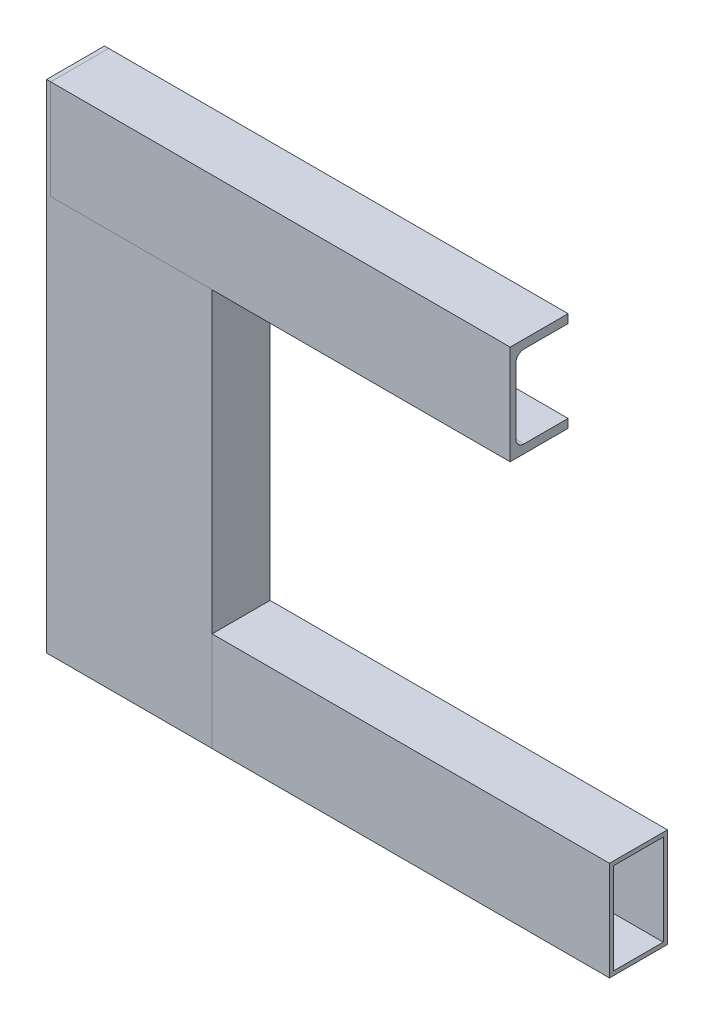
ISO-10303-21;
HEADER;
FILE_DESCRIPTION(('STEP AP214'),'2;1');
FILE_NAME('part.step','',(''),(''),'','','');
FILE_SCHEMA(('AUTOMOTIVE_DESIGN { 1 0 10303 214 1 1 1 1 }'));
ENDSEC;
DATA;
#1=APPLICATION_CONTEXT('core data for automotive mechanical design processes');
#2=APPLICATION_PROTOCOL_DEFINITION('international standard','automotive_design',2000,#1);
#3=PRODUCT_CONTEXT('',#1,'mechanical');
#4=PRODUCT('Part','Part','',(#3));
#5=PRODUCT_RELATED_PRODUCT_CATEGORY('part','',(#4));
#6=PRODUCT_DEFINITION_FORMATION('','',#4);
#7=PRODUCT_DEFINITION_CONTEXT('part definition',#1,'design');
#8=PRODUCT_DEFINITION('design','',#6,#7);
#9=PRODUCT_DEFINITION_SHAPE('','',#8);
#10=(LENGTH_UNIT() NAMED_UNIT(*) SI_UNIT(.MILLI.,.METRE.));
#11=(NAMED_UNIT(*) PLANE_ANGLE_UNIT() SI_UNIT($,.RADIAN.));
#12=(NAMED_UNIT(*) SI_UNIT($,.STERADIAN.) SOLID_ANGLE_UNIT());
#13=UNCERTAINTY_MEASURE_WITH_UNIT(LENGTH_MEASURE(1.E-05),#10,'distance_accuracy_value','');
#14=(GEOMETRIC_REPRESENTATION_CONTEXT(3) GLOBAL_UNCERTAINTY_ASSIGNED_CONTEXT((#13)) GLOBAL_UNIT_ASSIGNED_CONTEXT((#10,
#11,#12)) REPRESENTATION_CONTEXT('',''));
#15=CARTESIAN_POINT('',(0.,0.,0.));
#16=DIRECTION('',(0.,0.,1.));
#17=DIRECTION('',(1.,0.,0.));
#18=AXIS2_PLACEMENT_3D('',#15,#16,#17);
#19=CARTESIAN_POINT('',(431.8,-381.,0.));
#20=DIRECTION('',(0.,0.,-1.));
#21=DIRECTION('',(-1.,0.,0.));
#22=AXIS2_PLACEMENT_3D('',#19,#20,#21);
#23=PLANE('',#22);
#24=DIRECTION('',(0.,1.,0.));
#25=VECTOR('',#24,1.);
#26=CARTESIAN_POINT('',(127.,-381.,0.));
#27=LINE('',#26,#25);
#28=CARTESIAN_POINT('',(127.,-381.,0.));
#29=VERTEX_POINT('',#28);
#30=CARTESIAN_POINT('',(127.,-304.8,0.));
#31=VERTEX_POINT('',#30);
#32=EDGE_CURVE('E55',#29,#31,#27,.T.);
#33=ORIENTED_EDGE('',*,*,#32,.F.);
#34=DIRECTION('',(-1.,0.,0.));
#35=VECTOR('',#34,1.);
#36=CARTESIAN_POINT('',(431.8,-381.,0.));
#37=LINE('',#36,#35);
#38=CARTESIAN_POINT('',(431.8,-381.,0.));
#39=VERTEX_POINT('',#38);
#40=EDGE_CURVE('E119',#39,#29,#37,.T.);
#41=ORIENTED_EDGE('',*,*,#40,.F.);
#42=DIRECTION('',(0.,-1.,0.));
#43=VECTOR('',#42,1.);
#44=CARTESIAN_POINT('',(431.8,-381.,0.));
#45=LINE('',#44,#43);
#46=CARTESIAN_POINT('',(431.8,-304.8,0.));
#47=VERTEX_POINT('',#46);
#48=EDGE_CURVE('E157',#47,#39,#45,.T.);
#49=ORIENTED_EDGE('',*,*,#48,.F.);
#50=DIRECTION('',(-1.,0.,0.));
#51=VECTOR('',#50,1.);
#52=CARTESIAN_POINT('',(431.8,-304.8,0.));
#53=LINE('',#52,#51);
#54=EDGE_CURVE('E122',#47,#31,#53,.T.);
#55=ORIENTED_EDGE('',*,*,#54,.T.);
#56=EDGE_LOOP('',(#33,#41,#49,#55));
#57=FACE_BOUND('',#56,.T.);
#58=ADVANCED_FACE('F46',(#57),#23,.F.);
#59=CARTESIAN_POINT('',(431.8,-304.8,-44.45));
#60=DIRECTION('',(0.,-1.,0.));
#61=DIRECTION('',(0.,0.,-1.));
#62=AXIS2_PLACEMENT_3D('',#59,#60,#61);
#63=PLANE('',#62);
#64=DIRECTION('',(0.,0.,-1.));
#65=VECTOR('',#64,1.);
#66=CARTESIAN_POINT('',(127.,-304.8,-44.45));
#67=LINE('',#66,#65);
#68=CARTESIAN_POINT('',(127.,-304.8,-44.45));
#69=VERTEX_POINT('',#68);
#70=EDGE_CURVE('E12',#31,#69,#67,.T.);
#71=ORIENTED_EDGE('',*,*,#70,.F.);
#72=ORIENTED_EDGE('',*,*,#54,.F.);
#73=DIRECTION('',(0.,0.,1.));
#74=VECTOR('',#73,1.);
#75=CARTESIAN_POINT('',(431.8,-304.8,-44.45));
#76=LINE('',#75,#74);
#77=CARTESIAN_POINT('',(431.8,-304.8,-44.45));
#78=VERTEX_POINT('',#77);
#79=EDGE_CURVE('E159',#78,#47,#76,.T.);
#80=ORIENTED_EDGE('',*,*,#79,.F.);
#81=DIRECTION('',(-1.,0.,0.));
#82=VECTOR('',#81,1.);
#83=CARTESIAN_POINT('',(431.8,-304.8,-44.45));
#84=LINE('',#83,#82);
#85=EDGE_CURVE('E168',#78,#69,#84,.T.);
#86=ORIENTED_EDGE('',*,*,#85,.T.);
#87=EDGE_LOOP('',(#71,#72,#80,#86));
#88=FACE_BOUND('',#87,.T.);
#89=ADVANCED_FACE('F183',(#88),#63,.F.);
#90=CARTESIAN_POINT('',(431.8,-381.,-44.45));
#91=DIRECTION('',(0.,0.,1.));
#92=DIRECTION('',(1.,0.,0.));
#93=AXIS2_PLACEMENT_3D('',#90,#91,#92);
#94=PLANE('',#93);
#95=DIRECTION('',(0.,1.,0.));
#96=VECTOR('',#95,1.);
#97=CARTESIAN_POINT('',(127.,-381.,-44.45));
#98=LINE('',#97,#96);
#99=CARTESIAN_POINT('',(127.,-381.,-44.45));
#100=VERTEX_POINT('',#99);
#101=EDGE_CURVE('E62',#100,#69,#98,.T.);
#102=ORIENTED_EDGE('',*,*,#101,.T.);
#103=ORIENTED_EDGE('',*,*,#85,.F.);
#104=DIRECTION('',(0.,1.,0.));
#105=VECTOR('',#104,1.);
#106=CARTESIAN_POINT('',(431.8,-381.,-44.45));
#107=LINE('',#106,#105);
#108=CARTESIAN_POINT('',(431.8,-381.,-44.45));
#109=VERTEX_POINT('',#108);
#110=EDGE_CURVE('E129',#109,#78,#107,.T.);
#111=ORIENTED_EDGE('',*,*,#110,.F.);
#112=DIRECTION('',(-1.,0.,0.));
#113=VECTOR('',#112,1.);
#114=CARTESIAN_POINT('',(431.8,-381.,-44.45));
#115=LINE('',#114,#113);
#116=EDGE_CURVE('E127',#109,#100,#115,.T.);
#117=ORIENTED_EDGE('',*,*,#116,.T.);
#118=EDGE_LOOP('',(#102,#103,#111,#117));
#119=FACE_BOUND('',#118,.T.);
#120=ADVANCED_FACE('F185',(#119),#94,.F.);
#121=CARTESIAN_POINT('',(431.8,-381.,-44.45));
#122=DIRECTION('',(0.,1.,0.));
#123=DIRECTION('',(0.,0.,1.));
#124=AXIS2_PLACEMENT_3D('',#121,#122,#123);
#125=PLANE('',#124);
#126=DIRECTION('',(0.,0.,1.));
#127=VECTOR('',#126,1.);
#128=CARTESIAN_POINT('',(127.,-381.,-44.45));
#129=LINE('',#128,#127);
#130=EDGE_CURVE('E106',#100,#29,#129,.T.);
#131=ORIENTED_EDGE('',*,*,#130,.F.);
#132=ORIENTED_EDGE('',*,*,#116,.F.);
#133=DIRECTION('',(0.,0.,-1.));
#134=VECTOR('',#133,1.);
#135=CARTESIAN_POINT('',(431.8,-381.,-44.45));
#136=LINE('',#135,#134);
#137=EDGE_CURVE('E126',#39,#109,#136,.T.);
#138=ORIENTED_EDGE('',*,*,#137,.F.);
#139=ORIENTED_EDGE('',*,*,#40,.T.);
#140=EDGE_LOOP('',(#131,#132,#138,#139));
#141=FACE_BOUND('',#140,.T.);
#142=ADVANCED_FACE('F124',(#141),#125,.F.);
#143=CARTESIAN_POINT('',(431.8,-381.,0.));
#144=DIRECTION('',(-1.,0.,0.));
#145=DIRECTION('',(0.,0.,1.));
#146=AXIS2_PLACEMENT_3D('',#143,#144,#145);
#147=PLANE('',#146);
#148=ORIENTED_EDGE('',*,*,#137,.T.);
#149=ORIENTED_EDGE('',*,*,#110,.T.);
#150=ORIENTED_EDGE('',*,*,#79,.T.);
#151=ORIENTED_EDGE('',*,*,#48,.T.);
#152=EDGE_LOOP('',(#148,#149,#150,#151));
#153=FACE_BOUND('',#152,.T.);
#154=DIRECTION('',(0.,0.,-1.));
#155=VECTOR('',#154,1.);
#156=CARTESIAN_POINT('',(431.8,-377.825,-41.275));
#157=LINE('',#156,#155);
#158=CARTESIAN_POINT('',(431.8,-377.825,-3.175));
#159=VERTEX_POINT('',#158);
#160=CARTESIAN_POINT('',(431.8,-377.825,-41.275));
#161=VERTEX_POINT('',#160);
#162=EDGE_CURVE('E113',#159,#161,#157,.T.);
#163=ORIENTED_EDGE('',*,*,#162,.F.);
#164=DIRECTION('',(0.,-1.,0.));
#165=VECTOR('',#164,1.);
#166=CARTESIAN_POINT('',(431.8,-377.825,-3.175));
#167=LINE('',#166,#165);
#168=CARTESIAN_POINT('',(431.8,-307.975,-3.175));
#169=VERTEX_POINT('',#168);
#170=EDGE_CURVE('E150',#169,#159,#167,.T.);
#171=ORIENTED_EDGE('',*,*,#170,.F.);
#172=DIRECTION('',(0.,0.,1.));
#173=VECTOR('',#172,1.);
#174=CARTESIAN_POINT('',(431.8,-307.975,-41.275));
#175=LINE('',#174,#173);
#176=CARTESIAN_POINT('',(431.8,-307.975,-41.275));
#177=VERTEX_POINT('',#176);
#178=EDGE_CURVE('E139',#177,#169,#175,.T.);
#179=ORIENTED_EDGE('',*,*,#178,.F.);
#180=DIRECTION('',(0.,1.,0.));
#181=VECTOR('',#180,1.);
#182=CARTESIAN_POINT('',(431.8,-377.825,-41.275));
#183=LINE('',#182,#181);
#184=EDGE_CURVE('E144',#161,#177,#183,.T.);
#185=ORIENTED_EDGE('',*,*,#184,.F.);
#186=EDGE_LOOP('',(#163,#171,#179,#185));
#187=FACE_BOUND('',#186,.T.);
#188=ADVANCED_FACE('F187',(#153,#187),#147,.F.);
#189=CARTESIAN_POINT('',(431.8,-377.825,-41.275));
#190=DIRECTION('',(0.,0.,1.));
#191=DIRECTION('',(1.,0.,0.));
#192=AXIS2_PLACEMENT_3D('',#189,#190,#191);
#193=PLANE('',#192);
#194=DIRECTION('',(-1.,0.,0.));
#195=VECTOR('',#194,1.);
#196=CARTESIAN_POINT('',(431.8,-307.975,-41.275));
#197=LINE('',#196,#195);
#198=CARTESIAN_POINT('',(127.,-307.975,-41.275));
#199=VERTEX_POINT('',#198);
#200=EDGE_CURVE('E50',#177,#199,#197,.T.);
#201=ORIENTED_EDGE('',*,*,#200,.T.);
#202=DIRECTION('',(0.,-1.,0.));
#203=VECTOR('',#202,1.);
#204=CARTESIAN_POINT('',(127.,-377.825,-41.275));
#205=LINE('',#204,#203);
#206=CARTESIAN_POINT('',(127.,-377.825,-41.275));
#207=VERTEX_POINT('',#206);
#208=EDGE_CURVE('E147',#199,#207,#205,.T.);
#209=ORIENTED_EDGE('',*,*,#208,.T.);
#210=DIRECTION('',(-1.,0.,0.));
#211=VECTOR('',#210,1.);
#212=CARTESIAN_POINT('',(431.8,-377.825,-41.275));
#213=LINE('',#212,#211);
#214=EDGE_CURVE('E153',#161,#207,#213,.T.);
#215=ORIENTED_EDGE('',*,*,#214,.F.);
#216=ORIENTED_EDGE('',*,*,#184,.T.);
#217=EDGE_LOOP('',(#201,#209,#215,#216));
#218=FACE_BOUND('',#217,.T.);
#219=ADVANCED_FACE('F176',(#218),#193,.T.);
#220=CARTESIAN_POINT('',(431.8,-307.975,-41.275));
#221=DIRECTION('',(0.,-1.,0.));
#222=DIRECTION('',(0.,0.,-1.));
#223=AXIS2_PLACEMENT_3D('',#220,#221,#222);
#224=PLANE('',#223);
#225=DIRECTION('',(-1.,0.,0.));
#226=VECTOR('',#225,1.);
#227=CARTESIAN_POINT('',(431.8,-307.975,-3.175));
#228=LINE('',#227,#226);
#229=CARTESIAN_POINT('',(127.,-307.975,-3.175));
#230=VERTEX_POINT('',#229);
#231=EDGE_CURVE('E140',#169,#230,#228,.T.);
#232=ORIENTED_EDGE('',*,*,#231,.T.);
#233=DIRECTION('',(0.,0.,-1.));
#234=VECTOR('',#233,1.);
#235=CARTESIAN_POINT('',(127.,-307.975,-41.275));
#236=LINE('',#235,#234);
#237=EDGE_CURVE('E143',#230,#199,#236,.T.);
#238=ORIENTED_EDGE('',*,*,#237,.T.);
#239=ORIENTED_EDGE('',*,*,#200,.F.);
#240=ORIENTED_EDGE('',*,*,#178,.T.);
#241=EDGE_LOOP('',(#232,#238,#239,#240));
#242=FACE_BOUND('',#241,.T.);
#243=ADVANCED_FACE('F196',(#242),#224,.T.);
#244=CARTESIAN_POINT('',(431.8,-377.825,-3.175));
#245=DIRECTION('',(0.,0.,-1.));
#246=DIRECTION('',(-1.,0.,0.));
#247=AXIS2_PLACEMENT_3D('',#244,#245,#246);
#248=PLANE('',#247);
#249=DIRECTION('',(-1.,0.,0.));
#250=VECTOR('',#249,1.);
#251=CARTESIAN_POINT('',(431.8,-377.825,-3.175));
#252=LINE('',#251,#250);
#253=CARTESIAN_POINT('',(127.,-377.825,-3.175));
#254=VERTEX_POINT('',#253);
#255=EDGE_CURVE('E135',#159,#254,#252,.T.);
#256=ORIENTED_EDGE('',*,*,#255,.T.);
#257=DIRECTION('',(0.,1.,0.));
#258=VECTOR('',#257,1.);
#259=CARTESIAN_POINT('',(127.,-377.825,-3.175));
#260=LINE('',#259,#258);
#261=EDGE_CURVE('E138',#254,#230,#260,.T.);
#262=ORIENTED_EDGE('',*,*,#261,.T.);
#263=ORIENTED_EDGE('',*,*,#231,.F.);
#264=ORIENTED_EDGE('',*,*,#170,.T.);
#265=EDGE_LOOP('',(#256,#262,#263,#264));
#266=FACE_BOUND('',#265,.T.);
#267=ADVANCED_FACE('F194',(#266),#248,.T.);
#268=CARTESIAN_POINT('',(431.8,-377.825,-41.275));
#269=DIRECTION('',(0.,1.,0.));
#270=DIRECTION('',(0.,0.,1.));
#271=AXIS2_PLACEMENT_3D('',#268,#269,#270);
#272=PLANE('',#271);
#273=ORIENTED_EDGE('',*,*,#214,.T.);
#274=DIRECTION('',(0.,0.,1.));
#275=VECTOR('',#274,1.);
#276=CARTESIAN_POINT('',(127.,-377.825,-41.275));
#277=LINE('',#276,#275);
#278=EDGE_CURVE('E156',#207,#254,#277,.T.);
#279=ORIENTED_EDGE('',*,*,#278,.T.);
#280=ORIENTED_EDGE('',*,*,#255,.F.);
#281=ORIENTED_EDGE('',*,*,#162,.T.);
#282=EDGE_LOOP('',(#273,#279,#280,#281));
#283=FACE_BOUND('',#282,.T.);
#284=ADVANCED_FACE('F48',(#283),#272,.T.);
#285=CARTESIAN_POINT('',(127.,-381.,0.));
#286=DIRECTION('',(-1.,0.,0.));
#287=DIRECTION('',(0.,-1.,0.));
#288=AXIS2_PLACEMENT_3D('',#285,#286,#287);
#289=PLANE('',#288);
#290=ORIENTED_EDGE('',*,*,#208,.F.);
#291=ORIENTED_EDGE('',*,*,#237,.F.);
#292=ORIENTED_EDGE('',*,*,#261,.F.);
#293=ORIENTED_EDGE('',*,*,#278,.F.);
#294=EDGE_LOOP('',(#290,#291,#292,#293));
#295=FACE_BOUND('',#294,.T.);
#296=ORIENTED_EDGE('',*,*,#130,.T.);
#297=ORIENTED_EDGE('',*,*,#32,.T.);
#298=ORIENTED_EDGE('',*,*,#70,.T.);
#299=ORIENTED_EDGE('',*,*,#101,.F.);
#300=EDGE_LOOP('',(#296,#297,#298,#299));
#301=FACE_BOUND('',#300,.T.);
#302=ADVANCED_FACE('F108',(#295,#301),#289,.T.);
#303=CLOSED_SHELL('',(#58,#89,#120,#142,#188,#219,#243,#267,#284,#302));
#304=MANIFOLD_SOLID_BREP('B2',#303);
#305=CARTESIAN_POINT('',(3.17500000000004,-381.,-3.175));
#306=DIRECTION('',(0.,0.,-1.));
#307=DIRECTION('',(-1.,0.,0.));
#308=AXIS2_PLACEMENT_3D('',#305,#306,#307);
#309=PLANE('',#308);
#310=DIRECTION('',(-1.,0.,0.));
#311=VECTOR('',#310,1.);
#312=CARTESIAN_POINT('',(3.17500000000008,-76.2,-3.175));
#313=LINE('',#312,#311);
#314=CARTESIAN_POINT('',(123.825,-76.2,-3.175));
#315=VERTEX_POINT('',#314);
#316=CARTESIAN_POINT('',(3.17499999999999,-76.2,-3.175));
#317=VERTEX_POINT('',#316);
#318=EDGE_CURVE('E397',#315,#317,#313,.T.);
#319=ORIENTED_EDGE('',*,*,#318,.F.);
#320=DIRECTION('',(0.,1.,0.));
#321=VECTOR('',#320,1.);
#322=CARTESIAN_POINT('',(123.825,-381.,-3.175));
#323=LINE('',#322,#321);
#324=CARTESIAN_POINT('',(123.825,-381.,-3.175));
#325=VERTEX_POINT('',#324);
#326=EDGE_CURVE('E44',#325,#315,#323,.T.);
#327=ORIENTED_EDGE('',*,*,#326,.F.);
#328=DIRECTION('',(-1.,0.,0.));
#329=VECTOR('',#328,1.);
#330=CARTESIAN_POINT('',(3.17500000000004,-381.,-3.175));
#331=LINE('',#330,#329);
#332=CARTESIAN_POINT('',(3.17500000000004,-381.,-3.175));
#333=VERTEX_POINT('',#332);
#334=EDGE_CURVE('E385',#325,#333,#331,.T.);
#335=ORIENTED_EDGE('',*,*,#334,.T.);
#336=DIRECTION('',(0.,1.,0.));
#337=VECTOR('',#336,1.);
#338=CARTESIAN_POINT('',(3.17500000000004,-381.,-3.175));
#339=LINE('',#338,#337);
#340=EDGE_CURVE('E324',#333,#317,#339,.T.);
#341=ORIENTED_EDGE('',*,*,#340,.T.);
#342=EDGE_LOOP('',(#319,#327,#335,#341));
#343=FACE_BOUND('',#342,.T.);
#344=ADVANCED_FACE('F305',(#343),#309,.T.);
#345=CARTESIAN_POINT('',(123.825,-381.,-3.175));
#346=DIRECTION('',(-1.,0.,0.));
#347=DIRECTION('',(0.,-1.,0.));
#348=AXIS2_PLACEMENT_3D('',#345,#346,#347);
#349=PLANE('',#348);
#350=DIRECTION('',(0.,0.,1.));
#351=VECTOR('',#350,1.);
#352=CARTESIAN_POINT('',(123.825,-76.2,-3.175));
#353=LINE('',#352,#351);
#354=CARTESIAN_POINT('',(123.825,-76.2,-41.275));
#355=VERTEX_POINT('',#354);
#356=EDGE_CURVE('E348',#355,#315,#353,.T.);
#357=ORIENTED_EDGE('',*,*,#356,.F.);
#358=DIRECTION('',(0.,1.,0.));
#359=VECTOR('',#358,1.);
#360=CARTESIAN_POINT('',(123.825,-381.,-41.275));
#361=LINE('',#360,#359);
#362=CARTESIAN_POINT('',(123.825,-381.,-41.275));
#363=VERTEX_POINT('',#362);
#364=EDGE_CURVE('E315',#363,#355,#361,.T.);
#365=ORIENTED_EDGE('',*,*,#364,.F.);
#366=DIRECTION('',(0.,0.,1.));
#367=VECTOR('',#366,1.);
#368=CARTESIAN_POINT('',(123.825,-381.,-3.175));
#369=LINE('',#368,#367);
#370=EDGE_CURVE('E373',#363,#325,#369,.T.);
#371=ORIENTED_EDGE('',*,*,#370,.T.);
#372=ORIENTED_EDGE('',*,*,#326,.T.);
#373=EDGE_LOOP('',(#357,#365,#371,#372));
#374=FACE_BOUND('',#373,.T.);
#375=ADVANCED_FACE('F372',(#374),#349,.T.);
#376=CARTESIAN_POINT('',(3.17500000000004,-381.,-41.275));
#377=DIRECTION('',(0.,0.,1.));
#378=DIRECTION('',(1.,0.,0.));
#379=AXIS2_PLACEMENT_3D('',#376,#377,#378);
#380=PLANE('',#379);
#381=DIRECTION('',(1.,0.,0.));
#382=VECTOR('',#381,1.);
#383=CARTESIAN_POINT('',(3.17500000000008,-76.2,-41.275));
#384=LINE('',#383,#382);
#385=CARTESIAN_POINT('',(3.17499999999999,-76.2,-41.275));
#386=VERTEX_POINT('',#385);
#387=EDGE_CURVE('E486',#386,#355,#384,.T.);
#388=ORIENTED_EDGE('',*,*,#387,.F.);
#389=DIRECTION('',(0.,1.,0.));
#390=VECTOR('',#389,1.);
#391=CARTESIAN_POINT('',(3.17500000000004,-381.,-41.275));
#392=LINE('',#391,#390);
#393=CARTESIAN_POINT('',(3.17500000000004,-381.,-41.275));
#394=VERTEX_POINT('',#393);
#395=EDGE_CURVE('E377',#394,#386,#392,.T.);
#396=ORIENTED_EDGE('',*,*,#395,.F.);
#397=DIRECTION('',(1.,0.,0.));
#398=VECTOR('',#397,1.);
#399=CARTESIAN_POINT('',(3.17500000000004,-381.,-41.275));
#400=LINE('',#399,#398);
#401=EDGE_CURVE('E384',#394,#363,#400,.T.);
#402=ORIENTED_EDGE('',*,*,#401,.T.);
#403=ORIENTED_EDGE('',*,*,#364,.T.);
#404=EDGE_LOOP('',(#388,#396,#402,#403));
#405=FACE_BOUND('',#404,.T.);
#406=ADVANCED_FACE('F387',(#405),#380,.T.);
#407=CARTESIAN_POINT('',(0.,-381.,0.));
#408=DIRECTION('',(0.,0.,-1.));
#409=DIRECTION('',(-1.,0.,0.));
#410=AXIS2_PLACEMENT_3D('',#407,#408,#409);
#411=PLANE('',#410);
#412=DIRECTION('',(-1.,0.,0.));
#413=VECTOR('',#412,1.);
#414=CARTESIAN_POINT('',(3.17499999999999,-76.2,0.));
#415=LINE('',#414,#413);
#416=CARTESIAN_POINT('',(127.,-76.2,0.));
#417=VERTEX_POINT('',#416);
#418=CARTESIAN_POINT('',(3.17499999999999,-76.2,0.));
#419=VERTEX_POINT('',#418);
#420=EDGE_CURVE('E478',#417,#419,#415,.T.);
#421=ORIENTED_EDGE('',*,*,#420,.T.);
#422=DIRECTION('',(0.,1.,0.));
#423=VECTOR('',#422,1.);
#424=CARTESIAN_POINT('',(3.175,0.,0.));
#425=LINE('',#424,#423);
#426=CARTESIAN_POINT('',(3.175,0.,0.));
#427=VERTEX_POINT('',#426);
#428=EDGE_CURVE('E480',#419,#427,#425,.T.);
#429=ORIENTED_EDGE('',*,*,#428,.T.);
#430=DIRECTION('',(-1.,0.,0.));
#431=VECTOR('',#430,1.);
#432=CARTESIAN_POINT('',(0.,0.,0.));
#433=LINE('',#432,#431);
#434=CARTESIAN_POINT('',(0.,0.,0.));
#435=VERTEX_POINT('',#434);
#436=EDGE_CURVE('E337',#427,#435,#433,.T.);
#437=ORIENTED_EDGE('',*,*,#436,.T.);
#438=DIRECTION('',(0.,1.,0.));
#439=VECTOR('',#438,1.);
#440=CARTESIAN_POINT('',(0.,-381.,0.));
#441=LINE('',#440,#439);
#442=CARTESIAN_POINT('',(0.,-381.,0.));
#443=VERTEX_POINT('',#442);
#444=EDGE_CURVE('E309',#443,#435,#441,.T.);
#445=ORIENTED_EDGE('',*,*,#444,.F.);
#446=DIRECTION('',(-1.,0.,0.));
#447=VECTOR('',#446,1.);
#448=CARTESIAN_POINT('',(0.,-381.,0.));
#449=LINE('',#448,#447);
#450=CARTESIAN_POINT('',(127.,-381.,0.));
#451=VERTEX_POINT('',#450);
#452=EDGE_CURVE('E406',#451,#443,#449,.T.);
#453=ORIENTED_EDGE('',*,*,#452,.F.);
#454=DIRECTION('',(0.,1.,0.));
#455=VECTOR('',#454,1.);
#456=CARTESIAN_POINT('',(127.,-381.,0.));
#457=LINE('',#456,#455);
#458=EDGE_CURVE('E391',#451,#417,#457,.T.);
#459=ORIENTED_EDGE('',*,*,#458,.T.);
#460=EDGE_LOOP('',(#421,#429,#437,#445,#453,#459));
#461=FACE_BOUND('',#460,.T.);
#462=ADVANCED_FACE('F307',(#461),#411,.F.);
#463=CARTESIAN_POINT('',(0.,-381.,0.));
#464=DIRECTION('',(1.,0.,0.));
#465=DIRECTION('',(0.,1.,0.));
#466=AXIS2_PLACEMENT_3D('',#463,#464,#465);
#467=PLANE('',#466);
#468=DIRECTION('',(0.,0.,-1.));
#469=VECTOR('',#468,1.);
#470=CARTESIAN_POINT('',(0.,0.,0.));
#471=LINE('',#470,#469);
#472=CARTESIAN_POINT('',(0.,0.,-44.45));
#473=VERTEX_POINT('',#472);
#474=EDGE_CURVE('E396',#435,#473,#471,.T.);
#475=ORIENTED_EDGE('',*,*,#474,.T.);
#476=CARTESIAN_POINT('',(0.,-38.1,-152.21307345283));
#477=DIRECTION('',(1.,0.,0.));
#478=DIRECTION('',(0.,0.,-1.));
#479=AXIS2_PLACEMENT_3D('',#476,#477,#478);
#480=CIRCLE('',#479,114.3);
#481=CARTESIAN_POINT('',(0.,-76.2,-44.45));
#482=VERTEX_POINT('',#481);
#483=EDGE_CURVE('E470',#473,#482,#480,.T.);
#484=ORIENTED_EDGE('',*,*,#483,.T.);
#485=DIRECTION('',(0.,1.,0.));
#486=VECTOR('',#485,1.);
#487=CARTESIAN_POINT('',(0.,-381.,-44.45));
#488=LINE('',#487,#486);
#489=CARTESIAN_POINT('',(0.,-381.,-44.45));
#490=VERTEX_POINT('',#489);
#491=EDGE_CURVE('E413',#490,#482,#488,.T.);
#492=ORIENTED_EDGE('',*,*,#491,.F.);
#493=DIRECTION('',(0.,0.,-1.));
#494=VECTOR('',#493,1.);
#495=CARTESIAN_POINT('',(0.,-381.,0.));
#496=LINE('',#495,#494);
#497=EDGE_CURVE('E425',#443,#490,#496,.T.);
#498=ORIENTED_EDGE('',*,*,#497,.F.);
#499=ORIENTED_EDGE('',*,*,#444,.T.);
#500=EDGE_LOOP('',(#475,#484,#492,#498,#499));
#501=FACE_BOUND('',#500,.T.);
#502=ADVANCED_FACE('F422',(#501),#467,.F.);
#503=CARTESIAN_POINT('',(0.,-381.,-44.45));
#504=DIRECTION('',(0.,0.,1.));
#505=DIRECTION('',(1.,0.,0.));
#506=AXIS2_PLACEMENT_3D('',#503,#504,#505);
#507=PLANE('',#506);
#508=ORIENTED_EDGE('',*,*,#491,.T.);
#509=DIRECTION('',(1.,0.,0.));
#510=VECTOR('',#509,1.);
#511=CARTESIAN_POINT('',(0.,-76.2,-44.45));
#512=LINE('',#511,#510);
#513=CARTESIAN_POINT('',(3.17499999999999,-76.2,-44.45));
#514=VERTEX_POINT('',#513);
#515=EDGE_CURVE('E468',#482,#514,#512,.T.);
#516=ORIENTED_EDGE('',*,*,#515,.T.);
#517=DIRECTION('',(-1.,0.,0.));
#518=VECTOR('',#517,1.);
#519=CARTESIAN_POINT('',(3.17499999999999,-76.2,-44.45));
#520=LINE('',#519,#518);
#521=CARTESIAN_POINT('',(127.,-76.2,-44.45));
#522=VERTEX_POINT('',#521);
#523=EDGE_CURVE('E473',#522,#514,#520,.T.);
#524=ORIENTED_EDGE('',*,*,#523,.F.);
#525=DIRECTION('',(0.,1.,0.));
#526=VECTOR('',#525,1.);
#527=CARTESIAN_POINT('',(127.,-381.,-44.45));
#528=LINE('',#527,#526);
#529=CARTESIAN_POINT('',(127.,-381.,-44.45));
#530=VERTEX_POINT('',#529);
#531=EDGE_CURVE('E411',#530,#522,#528,.T.);
#532=ORIENTED_EDGE('',*,*,#531,.F.);
#533=DIRECTION('',(1.,0.,0.));
#534=VECTOR('',#533,1.);
#535=CARTESIAN_POINT('',(0.,-381.,-44.45));
#536=LINE('',#535,#534);
#537=EDGE_CURVE('E433',#490,#530,#536,.T.);
#538=ORIENTED_EDGE('',*,*,#537,.F.);
#539=EDGE_LOOP('',(#508,#516,#524,#532,#538));
#540=FACE_BOUND('',#539,.T.);
#541=ADVANCED_FACE('F495',(#540),#507,.F.);
#542=CARTESIAN_POINT('',(127.,-381.,0.));
#543=DIRECTION('',(-1.,0.,0.));
#544=DIRECTION('',(0.,-1.,0.));
#545=AXIS2_PLACEMENT_3D('',#542,#543,#544);
#546=PLANE('',#545);
#547=ORIENTED_EDGE('',*,*,#531,.T.);
#548=DIRECTION('',(0.,0.,-1.));
#549=VECTOR('',#548,1.);
#550=CARTESIAN_POINT('',(127.,-76.2,0.));
#551=LINE('',#550,#549);
#552=EDGE_CURVE('E482',#417,#522,#551,.T.);
#553=ORIENTED_EDGE('',*,*,#552,.F.);
#554=ORIENTED_EDGE('',*,*,#458,.F.);
#555=DIRECTION('',(0.,0.,1.));
#556=VECTOR('',#555,1.);
#557=CARTESIAN_POINT('',(127.,-381.,0.));
#558=LINE('',#557,#556);
#559=EDGE_CURVE('E439',#530,#451,#558,.T.);
#560=ORIENTED_EDGE('',*,*,#559,.F.);
#561=EDGE_LOOP('',(#547,#553,#554,#560));
#562=FACE_BOUND('',#561,.T.);
#563=ADVANCED_FACE('F492',(#562),#546,.F.);
#564=CARTESIAN_POINT('',(3.17500000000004,-381.,-3.175));
#565=DIRECTION('',(1.,0.,0.));
#566=DIRECTION('',(0.,1.,0.));
#567=AXIS2_PLACEMENT_3D('',#564,#565,#566);
#568=PLANE('',#567);
#569=CARTESIAN_POINT('',(3.175,-38.1,-152.21307345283));
#570=DIRECTION('',(1.,0.,0.));
#571=DIRECTION('',(0.,1.,0.));
#572=AXIS2_PLACEMENT_3D('',#569,#570,#571);
#573=CIRCLE('',#572,114.3);
#574=CARTESIAN_POINT('',(3.175,0.,-44.45));
#575=VERTEX_POINT('',#574);
#576=EDGE_CURVE('E471',#575,#514,#573,.T.);
#577=ORIENTED_EDGE('',*,*,#576,.F.);
#578=DIRECTION('',(0.,0.,-1.));
#579=VECTOR('',#578,1.);
#580=CARTESIAN_POINT('',(3.175,0.,-3.175));
#581=LINE('',#580,#579);
#582=EDGE_CURVE('E403',#427,#575,#581,.T.);
#583=ORIENTED_EDGE('',*,*,#582,.F.);
#584=ORIENTED_EDGE('',*,*,#428,.F.);
#585=DIRECTION('',(0.,0.,-1.));
#586=VECTOR('',#585,1.);
#587=CARTESIAN_POINT('',(3.17499999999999,-76.2,0.));
#588=LINE('',#587,#586);
#589=EDGE_CURVE('E484',#419,#317,#588,.T.);
#590=ORIENTED_EDGE('',*,*,#589,.T.);
#591=ORIENTED_EDGE('',*,*,#340,.F.);
#592=DIRECTION('',(0.,0.,-1.));
#593=VECTOR('',#592,1.);
#594=CARTESIAN_POINT('',(3.17500000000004,-381.,-3.175));
#595=LINE('',#594,#593);
#596=EDGE_CURVE('E389',#333,#394,#595,.T.);
#597=ORIENTED_EDGE('',*,*,#596,.T.);
#598=ORIENTED_EDGE('',*,*,#395,.T.);
#599=EDGE_CURVE('E447',#386,#514,#588,.T.);
#600=ORIENTED_EDGE('',*,*,#599,.T.);
#601=EDGE_LOOP('',(#577,#583,#584,#590,#591,#597,#598,#600));
#602=FACE_BOUND('',#601,.T.);
#603=ADVANCED_FACE('F443',(#602),#568,.T.);
#604=CARTESIAN_POINT('',(127.,-381.,0.));
#605=DIRECTION('',(0.,1.,0.));
#606=DIRECTION('',(-1.,0.,0.));
#607=AXIS2_PLACEMENT_3D('',#604,#605,#606);
#608=PLANE('',#607);
#609=ORIENTED_EDGE('',*,*,#452,.T.);
#610=ORIENTED_EDGE('',*,*,#497,.T.);
#611=ORIENTED_EDGE('',*,*,#537,.T.);
#612=ORIENTED_EDGE('',*,*,#559,.T.);
#613=EDGE_LOOP('',(#609,#610,#611,#612));
#614=FACE_BOUND('',#613,.T.);
#615=ORIENTED_EDGE('',*,*,#334,.F.);
#616=ORIENTED_EDGE('',*,*,#370,.F.);
#617=ORIENTED_EDGE('',*,*,#401,.F.);
#618=ORIENTED_EDGE('',*,*,#596,.F.);
#619=EDGE_LOOP('',(#615,#616,#617,#618));
#620=FACE_BOUND('',#619,.T.);
#621=ADVANCED_FACE('F382',(#614,#620),#608,.F.);
#622=CARTESIAN_POINT('',(127.,0.,0.));
#623=DIRECTION('',(0.,1.,0.));
#624=DIRECTION('',(-1.,0.,0.));
#625=AXIS2_PLACEMENT_3D('',#622,#623,#624);
#626=PLANE('',#625);
#627=ORIENTED_EDGE('',*,*,#582,.T.);
#628=DIRECTION('',(1.,0.,0.));
#629=VECTOR('',#628,1.);
#630=CARTESIAN_POINT('',(0.,0.,-44.45));
#631=LINE('',#630,#629);
#632=EDGE_CURVE('E400',#473,#575,#631,.T.);
#633=ORIENTED_EDGE('',*,*,#632,.F.);
#634=ORIENTED_EDGE('',*,*,#474,.F.);
#635=ORIENTED_EDGE('',*,*,#436,.F.);
#636=EDGE_LOOP('',(#627,#633,#634,#635));
#637=FACE_BOUND('',#636,.T.);
#638=ADVANCED_FACE('F497',(#637),#626,.T.);
#639=CARTESIAN_POINT('',(3.17499999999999,-76.2,0.));
#640=DIRECTION('',(0.,-1.,0.));
#641=DIRECTION('',(1.,0.,0.));
#642=AXIS2_PLACEMENT_3D('',#639,#640,#641);
#643=PLANE('',#642);
#644=ORIENTED_EDGE('',*,*,#318,.T.);
#645=ORIENTED_EDGE('',*,*,#589,.F.);
#646=ORIENTED_EDGE('',*,*,#420,.F.);
#647=ORIENTED_EDGE('',*,*,#552,.T.);
#648=ORIENTED_EDGE('',*,*,#523,.T.);
#649=ORIENTED_EDGE('',*,*,#599,.F.);
#650=ORIENTED_EDGE('',*,*,#387,.T.);
#651=ORIENTED_EDGE('',*,*,#356,.T.);
#652=EDGE_LOOP('',(#644,#645,#646,#647,#648,#649,#650,#651));
#653=FACE_BOUND('',#652,.T.);
#654=ADVANCED_FACE('F488',(#653),#643,.F.);
#655=CARTESIAN_POINT('',(0.,-38.1,-152.21307345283));
#656=DIRECTION('',(1.,0.,0.));
#657=DIRECTION('',(0.,0.,-1.));
#658=AXIS2_PLACEMENT_3D('',#655,#656,#657);
#659=CYLINDRICAL_SURFACE('',#658,114.3);
#660=ORIENTED_EDGE('',*,*,#483,.F.);
#661=ORIENTED_EDGE('',*,*,#632,.T.);
#662=ORIENTED_EDGE('',*,*,#576,.T.);
#663=ORIENTED_EDGE('',*,*,#515,.F.);
#664=EDGE_LOOP('',(#660,#661,#662,#663));
#665=FACE_BOUND('',#664,.T.);
#666=ADVANCED_FACE('F469',(#665),#659,.F.);
#667=CLOSED_SHELL('',(#344,#375,#406,#462,#502,#541,#563,#603,#621,#638,#654,#666));
#668=MANIFOLD_SOLID_BREP('B6',#667);
#669=CARTESIAN_POINT('',(355.6,0.,0.));
#670=DIRECTION('',(0.,-1.,0.));
#671=DIRECTION('',(0.,0.,-1.));
#672=AXIS2_PLACEMENT_3D('',#669,#670,#671);
#673=PLANE('',#672);
#674=DIRECTION('',(0.,0.,-1.));
#675=VECTOR('',#674,1.);
#676=CARTESIAN_POINT('',(3.17499999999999,0.,0.));
#677=LINE('',#676,#675);
#678=CARTESIAN_POINT('',(3.17499999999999,0.,0.));
#679=VERTEX_POINT('',#678);
#680=CARTESIAN_POINT('',(3.17500000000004,0.,-44.45));
#681=VERTEX_POINT('',#680);
#682=EDGE_CURVE('E632',#679,#681,#677,.T.);
#683=ORIENTED_EDGE('',*,*,#682,.F.);
#684=DIRECTION('',(-1.,0.,0.));
#685=VECTOR('',#684,1.);
#686=CARTESIAN_POINT('',(355.6,0.,0.));
#687=LINE('',#686,#685);
#688=CARTESIAN_POINT('',(355.6,0.,0.));
#689=VERTEX_POINT('',#688);
#690=EDGE_CURVE('E303',#689,#679,#687,.T.);
#691=ORIENTED_EDGE('',*,*,#690,.F.);
#692=DIRECTION('',(0.,0.,1.));
#693=VECTOR('',#692,1.);
#694=CARTESIAN_POINT('',(355.6,0.,0.));
#695=LINE('',#694,#693);
#696=CARTESIAN_POINT('',(355.6,0.,-44.45));
#697=VERTEX_POINT('',#696);
#698=EDGE_CURVE('E753',#697,#689,#695,.T.);
#699=ORIENTED_EDGE('',*,*,#698,.F.);
#700=DIRECTION('',(-1.,0.,0.));
#701=VECTOR('',#700,1.);
#702=CARTESIAN_POINT('',(355.6,0.,-44.45));
#703=LINE('',#702,#701);
#704=EDGE_CURVE('E734',#697,#681,#703,.T.);
#705=ORIENTED_EDGE('',*,*,#704,.T.);
#706=EDGE_LOOP('',(#683,#691,#699,#705));
#707=FACE_BOUND('',#706,.T.);
#708=ADVANCED_FACE('F618',(#707),#673,.F.);
#709=CARTESIAN_POINT('',(355.6,0.,0.));
#710=DIRECTION('',(0.,0.,-1.));
#711=DIRECTION('',(0.,1.,0.));
#712=AXIS2_PLACEMENT_3D('',#709,#710,#711);
#713=PLANE('',#712);
#714=DIRECTION('',(0.,1.,0.));
#715=VECTOR('',#714,1.);
#716=CARTESIAN_POINT('',(3.17499999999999,0.,0.));
#717=LINE('',#716,#715);
#718=CARTESIAN_POINT('',(3.17499999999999,-76.2,0.));
#719=VERTEX_POINT('',#718);
#720=EDGE_CURVE('E696',#719,#679,#717,.T.);
#721=ORIENTED_EDGE('',*,*,#720,.F.);
#722=DIRECTION('',(-1.,0.,0.));
#723=VECTOR('',#722,1.);
#724=CARTESIAN_POINT('',(355.6,-76.2,0.));
#725=LINE('',#724,#723);
#726=CARTESIAN_POINT('',(355.6,-76.2,0.));
#727=VERTEX_POINT('',#726);
#728=EDGE_CURVE('E625',#727,#719,#725,.T.);
#729=ORIENTED_EDGE('',*,*,#728,.F.);
#730=DIRECTION('',(0.,-1.,0.));
#731=VECTOR('',#730,1.);
#732=CARTESIAN_POINT('',(355.6,0.,0.));
#733=LINE('',#732,#731);
#734=EDGE_CURVE('E751',#689,#727,#733,.T.);
#735=ORIENTED_EDGE('',*,*,#734,.F.);
#736=ORIENTED_EDGE('',*,*,#690,.T.);
#737=EDGE_LOOP('',(#721,#729,#735,#736));
#738=FACE_BOUND('',#737,.T.);
#739=ADVANCED_FACE('F707',(#738),#713,.F.);
#740=CARTESIAN_POINT('',(355.6,-76.2,0.));
#741=DIRECTION('',(0.,1.,0.));
#742=DIRECTION('',(0.,0.,1.));
#743=AXIS2_PLACEMENT_3D('',#740,#741,#742);
#744=PLANE('',#743);
#745=DIRECTION('',(0.,0.,-1.));
#746=VECTOR('',#745,1.);
#747=CARTESIAN_POINT('',(3.17499999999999,-76.2,0.));
#748=LINE('',#747,#746);
#749=CARTESIAN_POINT('',(3.17499999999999,-76.2,-44.45));
#750=VERTEX_POINT('',#749);
#751=EDGE_CURVE('E693',#719,#750,#748,.T.);
#752=ORIENTED_EDGE('',*,*,#751,.T.);
#753=DIRECTION('',(-1.,0.,0.));
#754=VECTOR('',#753,1.);
#755=CARTESIAN_POINT('',(355.6,-76.2,-44.45));
#756=LINE('',#755,#754);
#757=CARTESIAN_POINT('',(355.6,-76.2,-44.45));
#758=VERTEX_POINT('',#757);
#759=EDGE_CURVE('E713',#758,#750,#756,.T.);
#760=ORIENTED_EDGE('',*,*,#759,.F.);
#761=DIRECTION('',(0.,0.,-1.));
#762=VECTOR('',#761,1.);
#763=CARTESIAN_POINT('',(355.6,-76.2,0.));
#764=LINE('',#763,#762);
#765=EDGE_CURVE('E712',#727,#758,#764,.T.);
#766=ORIENTED_EDGE('',*,*,#765,.F.);
#767=ORIENTED_EDGE('',*,*,#728,.T.);
#768=EDGE_LOOP('',(#752,#760,#766,#767));
#769=FACE_BOUND('',#768,.T.);
#770=ADVANCED_FACE('F711',(#769),#744,.F.);
#771=CARTESIAN_POINT('',(355.6,-76.2,-44.45));
#772=DIRECTION('',(0.,0.,1.));
#773=DIRECTION('',(0.,-1.,0.));
#774=AXIS2_PLACEMENT_3D('',#771,#772,#773);
#775=PLANE('',#774);
#776=DIRECTION('',(0.,1.,0.));
#777=VECTOR('',#776,1.);
#778=CARTESIAN_POINT('',(3.17499999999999,0.,-44.45));
#779=LINE('',#778,#777);
#780=CARTESIAN_POINT('',(3.17499999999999,-69.596,-44.45));
#781=VERTEX_POINT('',#780);
#782=EDGE_CURVE('E698',#750,#781,#779,.T.);
#783=ORIENTED_EDGE('',*,*,#782,.T.);
#784=DIRECTION('',(-1.,0.,0.));
#785=VECTOR('',#784,1.);
#786=CARTESIAN_POINT('',(355.6,-69.596,-44.45));
#787=LINE('',#786,#785);
#788=CARTESIAN_POINT('',(355.6,-69.596,-44.45));
#789=VERTEX_POINT('',#788);
#790=EDGE_CURVE('E714',#789,#781,#787,.T.);
#791=ORIENTED_EDGE('',*,*,#790,.F.);
#792=DIRECTION('',(0.,1.,0.));
#793=VECTOR('',#792,1.);
#794=CARTESIAN_POINT('',(355.6,-76.2,-44.45));
#795=LINE('',#794,#793);
#796=EDGE_CURVE('E748',#758,#789,#795,.T.);
#797=ORIENTED_EDGE('',*,*,#796,.F.);
#798=ORIENTED_EDGE('',*,*,#759,.T.);
#799=EDGE_LOOP('',(#783,#791,#797,#798));
#800=FACE_BOUND('',#799,.T.);
#801=ADVANCED_FACE('F776',(#800),#775,.F.);
#802=CARTESIAN_POINT('',(355.6,-69.596,-10.668));
#803=DIRECTION('',(0.,-1.,0.));
#804=DIRECTION('',(0.,0.,-1.));
#805=AXIS2_PLACEMENT_3D('',#802,#803,#804);
#806=PLANE('',#805);
#807=DIRECTION('',(0.,0.,-1.));
#808=VECTOR('',#807,1.);
#809=CARTESIAN_POINT('',(3.17499999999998,-69.596,-10.668));
#810=LINE('',#809,#808);
#811=CARTESIAN_POINT('',(3.17499999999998,-69.596,-10.668));
#812=VERTEX_POINT('',#811);
#813=EDGE_CURVE('E755',#812,#781,#810,.T.);
#814=ORIENTED_EDGE('',*,*,#813,.F.);
#815=DIRECTION('',(-1.,0.,0.));
#816=VECTOR('',#815,1.);
#817=CARTESIAN_POINT('',(355.6,-69.596,-10.668));
#818=LINE('',#817,#816);
#819=CARTESIAN_POINT('',(355.6,-69.596,-10.668));
#820=VERTEX_POINT('',#819);
#821=EDGE_CURVE('E719',#820,#812,#818,.T.);
#822=ORIENTED_EDGE('',*,*,#821,.F.);
#823=DIRECTION('',(0.,0.,1.));
#824=VECTOR('',#823,1.);
#825=CARTESIAN_POINT('',(355.6,-69.596,-10.668));
#826=LINE('',#825,#824);
#827=EDGE_CURVE('E746',#789,#820,#826,.T.);
#828=ORIENTED_EDGE('',*,*,#827,.F.);
#829=ORIENTED_EDGE('',*,*,#790,.T.);
#830=EDGE_LOOP('',(#814,#822,#828,#829));
#831=FACE_BOUND('',#830,.T.);
#832=ADVANCED_FACE('F781',(#831),#806,.F.);
#833=CARTESIAN_POINT('',(355.6,-63.246,-10.668));
#834=DIRECTION('',(-1.,0.,0.));
#835=DIRECTION('',(0.,0.,1.));
#836=AXIS2_PLACEMENT_3D('',#833,#834,#835);
#837=CYLINDRICAL_SURFACE('',#836,6.35);
#838=CARTESIAN_POINT('',(3.17499999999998,-63.246,-10.668));
#839=DIRECTION('',(-1.,0.,0.));
#840=DIRECTION('',(0.,0.,1.));
#841=AXIS2_PLACEMENT_3D('',#838,#839,#840);
#842=CIRCLE('',#841,6.35);
#843=CARTESIAN_POINT('',(3.17499999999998,-63.246,-4.318));
#844=VERTEX_POINT('',#843);
#845=EDGE_CURVE('E757',#844,#812,#842,.F.);
#846=ORIENTED_EDGE('',*,*,#845,.F.);
#847=DIRECTION('',(-1.,0.,0.));
#848=VECTOR('',#847,1.);
#849=CARTESIAN_POINT('',(355.6,-63.246,-4.318));
#850=LINE('',#849,#848);
#851=CARTESIAN_POINT('',(355.6,-63.246,-4.318));
#852=VERTEX_POINT('',#851);
#853=EDGE_CURVE('E722',#852,#844,#850,.T.);
#854=ORIENTED_EDGE('',*,*,#853,.F.);
#855=CARTESIAN_POINT('',(355.6,-63.246,-10.668));
#856=DIRECTION('',(-1.,0.,0.));
#857=DIRECTION('',(0.,0.,-1.));
#858=AXIS2_PLACEMENT_3D('',#855,#856,#857);
#859=CIRCLE('',#858,6.35);
#860=EDGE_CURVE('E744',#820,#852,#859,.T.);
#861=ORIENTED_EDGE('',*,*,#860,.F.);
#862=ORIENTED_EDGE('',*,*,#821,.T.);
#863=EDGE_LOOP('',(#846,#854,#861,#862));
#864=FACE_BOUND('',#863,.T.);
#865=ADVANCED_FACE('F788',(#864),#837,.F.);
#866=CARTESIAN_POINT('',(355.6,-12.954,-4.318));
#867=DIRECTION('',(0.,0.,1.));
#868=DIRECTION('',(1.,0.,0.));
#869=AXIS2_PLACEMENT_3D('',#866,#867,#868);
#870=PLANE('',#869);
#871=DIRECTION('',(0.,-1.,0.));
#872=VECTOR('',#871,1.);
#873=CARTESIAN_POINT('',(3.17499999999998,-12.954,-4.318));
#874=LINE('',#873,#872);
#875=CARTESIAN_POINT('',(3.17499999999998,-12.954,-4.318));
#876=VERTEX_POINT('',#875);
#877=EDGE_CURVE('E759',#876,#844,#874,.T.);
#878=ORIENTED_EDGE('',*,*,#877,.F.);
#879=DIRECTION('',(-1.,0.,0.));
#880=VECTOR('',#879,1.);
#881=CARTESIAN_POINT('',(355.6,-12.954,-4.318));
#882=LINE('',#881,#880);
#883=CARTESIAN_POINT('',(355.6,-12.954,-4.318));
#884=VERTEX_POINT('',#883);
#885=EDGE_CURVE('E725',#884,#876,#882,.T.);
#886=ORIENTED_EDGE('',*,*,#885,.F.);
#887=DIRECTION('',(0.,1.,0.));
#888=VECTOR('',#887,1.);
#889=CARTESIAN_POINT('',(355.6,-12.954,-4.318));
#890=LINE('',#889,#888);
#891=EDGE_CURVE('E742',#852,#884,#890,.T.);
#892=ORIENTED_EDGE('',*,*,#891,.F.);
#893=ORIENTED_EDGE('',*,*,#853,.T.);
#894=EDGE_LOOP('',(#878,#886,#892,#893));
#895=FACE_BOUND('',#894,.T.);
#896=ADVANCED_FACE('F791',(#895),#870,.F.);
#897=CARTESIAN_POINT('',(355.6,-12.954,-10.668));
#898=DIRECTION('',(-1.,0.,0.));
#899=DIRECTION('',(0.,0.,1.));
#900=AXIS2_PLACEMENT_3D('',#897,#898,#899);
#901=CYLINDRICAL_SURFACE('',#900,6.35);
#902=CARTESIAN_POINT('',(3.17499999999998,-12.954,-10.668));
#903=DIRECTION('',(-1.,0.,0.));
#904=DIRECTION('',(0.,0.,1.));
#905=AXIS2_PLACEMENT_3D('',#902,#903,#904);
#906=CIRCLE('',#905,6.35);
#907=CARTESIAN_POINT('',(3.17499999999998,-6.604,-10.668));
#908=VERTEX_POINT('',#907);
#909=EDGE_CURVE('E761',#908,#876,#906,.F.);
#910=ORIENTED_EDGE('',*,*,#909,.F.);
#911=DIRECTION('',(-1.,0.,0.));
#912=VECTOR('',#911,1.);
#913=CARTESIAN_POINT('',(355.6,-6.604,-10.668));
#914=LINE('',#913,#912);
#915=CARTESIAN_POINT('',(355.6,-6.604,-10.668));
#916=VERTEX_POINT('',#915);
#917=EDGE_CURVE('E728',#916,#908,#914,.T.);
#918=ORIENTED_EDGE('',*,*,#917,.F.);
#919=CARTESIAN_POINT('',(355.6,-12.954,-10.668));
#920=DIRECTION('',(-1.,0.,0.));
#921=DIRECTION('',(0.,0.,1.));
#922=AXIS2_PLACEMENT_3D('',#919,#920,#921);
#923=CIRCLE('',#922,6.35);
#924=EDGE_CURVE('E740',#884,#916,#923,.T.);
#925=ORIENTED_EDGE('',*,*,#924,.F.);
#926=ORIENTED_EDGE('',*,*,#885,.T.);
#927=EDGE_LOOP('',(#910,#918,#925,#926));
#928=FACE_BOUND('',#927,.T.);
#929=ADVANCED_FACE('F796',(#928),#901,.F.);
#930=CARTESIAN_POINT('',(355.6,-6.604,-10.668));
#931=DIRECTION('',(0.,1.,0.));
#932=DIRECTION('',(0.,0.,1.));
#933=AXIS2_PLACEMENT_3D('',#930,#931,#932);
#934=PLANE('',#933);
#935=DIRECTION('',(0.,0.,1.));
#936=VECTOR('',#935,1.);
#937=CARTESIAN_POINT('',(3.17499999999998,-6.604,-10.668));
#938=LINE('',#937,#936);
#939=CARTESIAN_POINT('',(3.17499999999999,-6.604,-44.45));
#940=VERTEX_POINT('',#939);
#941=EDGE_CURVE('E703',#940,#908,#938,.T.);
#942=ORIENTED_EDGE('',*,*,#941,.F.);
#943=DIRECTION('',(-1.,0.,0.));
#944=VECTOR('',#943,1.);
#945=CARTESIAN_POINT('',(355.6,-6.604,-44.45));
#946=LINE('',#945,#944);
#947=CARTESIAN_POINT('',(355.6,-6.604,-44.45));
#948=VERTEX_POINT('',#947);
#949=EDGE_CURVE('E731',#948,#940,#946,.T.);
#950=ORIENTED_EDGE('',*,*,#949,.F.);
#951=DIRECTION('',(0.,0.,-1.));
#952=VECTOR('',#951,1.);
#953=CARTESIAN_POINT('',(355.6,-6.604,-10.668));
#954=LINE('',#953,#952);
#955=EDGE_CURVE('E738',#916,#948,#954,.T.);
#956=ORIENTED_EDGE('',*,*,#955,.F.);
#957=ORIENTED_EDGE('',*,*,#917,.T.);
#958=EDGE_LOOP('',(#942,#950,#956,#957));
#959=FACE_BOUND('',#958,.T.);
#960=ADVANCED_FACE('F799',(#959),#934,.F.);
#961=CARTESIAN_POINT('',(355.6,0.,-44.45));
#962=DIRECTION('',(0.,0.,1.));
#963=DIRECTION('',(0.,-1.,0.));
#964=AXIS2_PLACEMENT_3D('',#961,#962,#963);
#965=PLANE('',#964);
#966=EDGE_CURVE('E765',#940,#681,#779,.T.);
#967=ORIENTED_EDGE('',*,*,#966,.T.);
#968=ORIENTED_EDGE('',*,*,#704,.F.);
#969=DIRECTION('',(0.,1.,0.));
#970=VECTOR('',#969,1.);
#971=CARTESIAN_POINT('',(355.6,0.,-44.45));
#972=LINE('',#971,#970);
#973=EDGE_CURVE('E640',#948,#697,#972,.T.);
#974=ORIENTED_EDGE('',*,*,#973,.F.);
#975=ORIENTED_EDGE('',*,*,#949,.T.);
#976=EDGE_LOOP('',(#967,#968,#974,#975));
#977=FACE_BOUND('',#976,.T.);
#978=ADVANCED_FACE('F769',(#977),#965,.F.);
#979=CARTESIAN_POINT('',(355.6,-12.954,-10.668));
#980=DIRECTION('',(-1.,0.,0.));
#981=DIRECTION('',(0.,0.,1.));
#982=AXIS2_PLACEMENT_3D('',#979,#980,#981);
#983=PLANE('',#982);
#984=ORIENTED_EDGE('',*,*,#698,.T.);
#985=ORIENTED_EDGE('',*,*,#734,.T.);
#986=ORIENTED_EDGE('',*,*,#765,.T.);
#987=ORIENTED_EDGE('',*,*,#796,.T.);
#988=ORIENTED_EDGE('',*,*,#827,.T.);
#989=ORIENTED_EDGE('',*,*,#860,.T.);
#990=ORIENTED_EDGE('',*,*,#891,.T.);
#991=ORIENTED_EDGE('',*,*,#924,.T.);
#992=ORIENTED_EDGE('',*,*,#955,.T.);
#993=ORIENTED_EDGE('',*,*,#973,.T.);
#994=EDGE_LOOP('',(#984,#985,#986,#987,#988,#989,#990,#991,#992,#993));
#995=FACE_BOUND('',#994,.T.);
#996=ADVANCED_FACE('F774',(#995),#983,.F.);
#997=CARTESIAN_POINT('',(3.17499999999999,0.,0.));
#998=DIRECTION('',(-1.,0.,0.));
#999=DIRECTION('',(0.,0.,1.));
#1000=AXIS2_PLACEMENT_3D('',#997,#998,#999);
#1001=PLANE('',#1000);
#1002=ORIENTED_EDGE('',*,*,#813,.T.);
#1003=ORIENTED_EDGE('',*,*,#782,.F.);
#1004=ORIENTED_EDGE('',*,*,#751,.F.);
#1005=ORIENTED_EDGE('',*,*,#720,.T.);
#1006=ORIENTED_EDGE('',*,*,#682,.T.);
#1007=ORIENTED_EDGE('',*,*,#966,.F.);
#1008=ORIENTED_EDGE('',*,*,#941,.T.);
#1009=ORIENTED_EDGE('',*,*,#909,.T.);
#1010=ORIENTED_EDGE('',*,*,#877,.T.);
#1011=ORIENTED_EDGE('',*,*,#845,.T.);
#1012=EDGE_LOOP('',(#1002,#1003,#1004,#1005,#1006,#1007,#1008,#1009,#1010,#1011));
#1013=FACE_BOUND('',#1012,.T.);
#1014=ADVANCED_FACE('F695',(#1013),#1001,.T.);
#1015=CLOSED_SHELL('',(#708,#739,#770,#801,#832,#865,#896,#929,#960,#978,#996,#1014));
#1016=MANIFOLD_SOLID_BREP('B38',#1015);
#1017=ADVANCED_BREP_SHAPE_REPRESENTATION('',(#18,#304,#668,#1016),#14);
#1018=SHAPE_DEFINITION_REPRESENTATION(#9,#1017);
ENDSEC;
END-ISO-10303-21;
